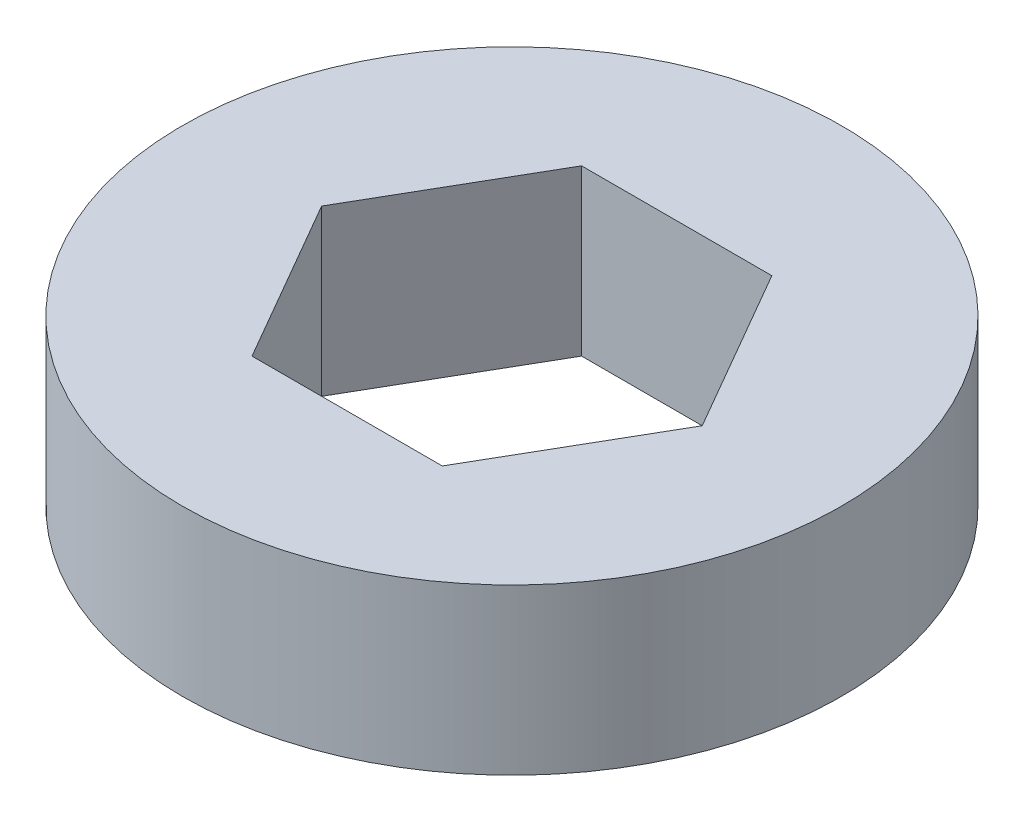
ISO-10303-21;
HEADER;
FILE_DESCRIPTION(('STEP AP214'),'2;1');
FILE_NAME('part.step','',(''),(''),'','','');
FILE_SCHEMA(('AUTOMOTIVE_DESIGN { 1 0 10303 214 1 1 1 1 }'));
ENDSEC;
DATA;
#1=APPLICATION_CONTEXT('core data for automotive mechanical design processes');
#2=APPLICATION_PROTOCOL_DEFINITION('international standard','automotive_design',2000,#1);
#3=PRODUCT_CONTEXT('',#1,'mechanical');
#4=PRODUCT('Part','Part','',(#3));
#5=PRODUCT_RELATED_PRODUCT_CATEGORY('part','',(#4));
#6=PRODUCT_DEFINITION_FORMATION('','',#4);
#7=PRODUCT_DEFINITION_CONTEXT('part definition',#1,'design');
#8=PRODUCT_DEFINITION('design','',#6,#7);
#9=PRODUCT_DEFINITION_SHAPE('','',#8);
#10=(LENGTH_UNIT() NAMED_UNIT(*) SI_UNIT(.MILLI.,.METRE.));
#11=(NAMED_UNIT(*) PLANE_ANGLE_UNIT() SI_UNIT($,.RADIAN.));
#12=(NAMED_UNIT(*) SI_UNIT($,.STERADIAN.) SOLID_ANGLE_UNIT());
#13=UNCERTAINTY_MEASURE_WITH_UNIT(LENGTH_MEASURE(1.E-05),#10,'distance_accuracy_value','');
#14=(GEOMETRIC_REPRESENTATION_CONTEXT(3) GLOBAL_UNCERTAINTY_ASSIGNED_CONTEXT((#13)) GLOBAL_UNIT_ASSIGNED_CONTEXT((#10,
#11,#12)) REPRESENTATION_CONTEXT('',''));
#15=CARTESIAN_POINT('',(0.,0.,0.));
#16=DIRECTION('',(0.,0.,1.));
#17=DIRECTION('',(1.,0.,0.));
#18=AXIS2_PLACEMENT_3D('',#15,#16,#17);
#19=CARTESIAN_POINT('',(0.,10.,0.));
#20=DIRECTION('',(0.,1.,0.));
#21=DIRECTION('',(0.,0.,1.));
#22=AXIS2_PLACEMENT_3D('',#19,#20,#21);
#23=PLANE('',#22);
#24=CARTESIAN_POINT('',(0.,10.,0.));
#25=DIRECTION('',(0.,1.,0.));
#26=DIRECTION('',(0.,0.,1.));
#27=AXIS2_PLACEMENT_3D('',#24,#25,#26);
#28=CIRCLE('',#27,20.);
#29=CARTESIAN_POINT('',(0.,10.,20.));
#30=VERTEX_POINT('',#29);
#31=EDGE_CURVE('E11',#30,#30,#28,.T.);
#32=ORIENTED_EDGE('',*,*,#31,.T.);
#33=EDGE_LOOP('',(#32));
#34=FACE_BOUND('',#33,.T.);
#35=DIRECTION('',(-0.5,0.,-0.866025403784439));
#36=VECTOR('',#35,1.);
#37=CARTESIAN_POINT('',(11.5470053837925,10.,0.));
#38=LINE('',#37,#36);
#39=CARTESIAN_POINT('',(11.5470053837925,10.,0.));
#40=VERTEX_POINT('',#39);
#41=CARTESIAN_POINT('',(5.77350269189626,10.,-10.));
#42=VERTEX_POINT('',#41);
#43=EDGE_CURVE('E94',#40,#42,#38,.T.);
#44=ORIENTED_EDGE('',*,*,#43,.F.);
#45=DIRECTION('',(0.5,0.,-0.866025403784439));
#46=VECTOR('',#45,1.);
#47=CARTESIAN_POINT('',(5.77350269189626,10.,10.));
#48=LINE('',#47,#46);
#49=CARTESIAN_POINT('',(5.77350269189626,10.,10.));
#50=VERTEX_POINT('',#49);
#51=EDGE_CURVE('E86',#50,#40,#48,.T.);
#52=ORIENTED_EDGE('',*,*,#51,.F.);
#53=DIRECTION('',(1.,0.,0.));
#54=VECTOR('',#53,1.);
#55=CARTESIAN_POINT('',(-5.77350269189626,10.,10.));
#56=LINE('',#55,#54);
#57=CARTESIAN_POINT('',(-5.77350269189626,10.,10.));
#58=VERTEX_POINT('',#57);
#59=EDGE_CURVE('E114',#58,#50,#56,.T.);
#60=ORIENTED_EDGE('',*,*,#59,.F.);
#61=DIRECTION('',(0.5,0.,0.866025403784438));
#62=VECTOR('',#61,1.);
#63=CARTESIAN_POINT('',(-11.5470053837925,10.,0.));
#64=LINE('',#63,#62);
#65=CARTESIAN_POINT('',(-11.5470053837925,10.,0.));
#66=VERTEX_POINT('',#65);
#67=EDGE_CURVE('E112',#66,#58,#64,.T.);
#68=ORIENTED_EDGE('',*,*,#67,.F.);
#69=DIRECTION('',(-0.5,0.,0.866025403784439));
#70=VECTOR('',#69,1.);
#71=CARTESIAN_POINT('',(-5.77350269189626,10.,-10.));
#72=LINE('',#71,#70);
#73=CARTESIAN_POINT('',(-5.77350269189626,10.,-10.));
#74=VERTEX_POINT('',#73);
#75=EDGE_CURVE('E108',#74,#66,#72,.T.);
#76=ORIENTED_EDGE('',*,*,#75,.F.);
#77=DIRECTION('',(-1.,0.,0.));
#78=VECTOR('',#77,1.);
#79=CARTESIAN_POINT('',(5.77350269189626,10.,-10.));
#80=LINE('',#79,#78);
#81=EDGE_CURVE('E106',#42,#74,#80,.T.);
#82=ORIENTED_EDGE('',*,*,#81,.F.);
#83=EDGE_LOOP('',(#44,#52,#60,#68,#76,#82));
#84=FACE_BOUND('',#83,.T.);
#85=ADVANCED_FACE('F33',(#34,#84),#23,.T.);
#86=CARTESIAN_POINT('',(0.,0.,0.));
#87=DIRECTION('',(0.,1.,0.));
#88=DIRECTION('',(0.,0.,1.));
#89=AXIS2_PLACEMENT_3D('',#86,#87,#88);
#90=PLANE('',#89);
#91=CARTESIAN_POINT('',(0.,0.,0.));
#92=DIRECTION('',(0.,1.,0.));
#93=DIRECTION('',(0.,0.,1.));
#94=AXIS2_PLACEMENT_3D('',#91,#92,#93);
#95=CIRCLE('',#94,20.);
#96=CARTESIAN_POINT('',(0.,0.,20.));
#97=VERTEX_POINT('',#96);
#98=EDGE_CURVE('E37',#97,#97,#95,.T.);
#99=ORIENTED_EDGE('',*,*,#98,.F.);
#100=EDGE_LOOP('',(#99));
#101=FACE_BOUND('',#100,.T.);
#102=DIRECTION('',(0.5,0.,-0.866025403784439));
#103=VECTOR('',#102,1.);
#104=CARTESIAN_POINT('',(5.77350269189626,0.,10.));
#105=LINE('',#104,#103);
#106=CARTESIAN_POINT('',(5.77350269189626,0.,10.));
#107=VERTEX_POINT('',#106);
#108=CARTESIAN_POINT('',(11.5470053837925,0.,0.));
#109=VERTEX_POINT('',#108);
#110=EDGE_CURVE('E56',#107,#109,#105,.T.);
#111=ORIENTED_EDGE('',*,*,#110,.T.);
#112=DIRECTION('',(-0.5,0.,-0.866025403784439));
#113=VECTOR('',#112,1.);
#114=CARTESIAN_POINT('',(11.5470053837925,0.,0.));
#115=LINE('',#114,#113);
#116=CARTESIAN_POINT('',(5.77350269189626,0.,-10.));
#117=VERTEX_POINT('',#116);
#118=EDGE_CURVE('E101',#109,#117,#115,.T.);
#119=ORIENTED_EDGE('',*,*,#118,.T.);
#120=DIRECTION('',(-1.,0.,0.));
#121=VECTOR('',#120,1.);
#122=CARTESIAN_POINT('',(5.77350269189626,0.,-10.));
#123=LINE('',#122,#121);
#124=CARTESIAN_POINT('',(-5.77350269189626,0.,-10.));
#125=VERTEX_POINT('',#124);
#126=EDGE_CURVE('E118',#117,#125,#123,.T.);
#127=ORIENTED_EDGE('',*,*,#126,.T.);
#128=DIRECTION('',(-0.5,0.,0.866025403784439));
#129=VECTOR('',#128,1.);
#130=CARTESIAN_POINT('',(-5.77350269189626,0.,-10.));
#131=LINE('',#130,#129);
#132=CARTESIAN_POINT('',(-11.5470053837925,0.,0.));
#133=VERTEX_POINT('',#132);
#134=EDGE_CURVE('E121',#125,#133,#131,.T.);
#135=ORIENTED_EDGE('',*,*,#134,.T.);
#136=DIRECTION('',(0.5,0.,0.866025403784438));
#137=VECTOR('',#136,1.);
#138=CARTESIAN_POINT('',(-11.5470053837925,0.,0.));
#139=LINE('',#138,#137);
#140=CARTESIAN_POINT('',(-5.77350269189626,0.,10.));
#141=VERTEX_POINT('',#140);
#142=EDGE_CURVE('E124',#133,#141,#139,.T.);
#143=ORIENTED_EDGE('',*,*,#142,.T.);
#144=DIRECTION('',(1.,0.,0.));
#145=VECTOR('',#144,1.);
#146=CARTESIAN_POINT('',(-5.77350269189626,0.,10.));
#147=LINE('',#146,#145);
#148=EDGE_CURVE('E95',#141,#107,#147,.T.);
#149=ORIENTED_EDGE('',*,*,#148,.T.);
#150=EDGE_LOOP('',(#111,#119,#127,#135,#143,#149));
#151=FACE_BOUND('',#150,.T.);
#152=ADVANCED_FACE('F141',(#101,#151),#90,.F.);
#153=CARTESIAN_POINT('',(0.,10.,0.));
#154=DIRECTION('',(0.,-1.,0.));
#155=DIRECTION('',(0.,0.,-1.));
#156=AXIS2_PLACEMENT_3D('',#153,#154,#155);
#157=CYLINDRICAL_SURFACE('',#156,20.);
#158=ORIENTED_EDGE('',*,*,#31,.F.);
#159=EDGE_LOOP('',(#158));
#160=FACE_BOUND('',#159,.T.);
#161=ORIENTED_EDGE('',*,*,#98,.T.);
#162=EDGE_LOOP('',(#161));
#163=FACE_BOUND('',#162,.T.);
#164=ADVANCED_FACE('F35',(#160,#163),#157,.T.);
#165=CARTESIAN_POINT('',(5.77350269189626,10.,10.));
#166=DIRECTION('',(-0.866025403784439,0.,-0.5));
#167=DIRECTION('',(-0.5,0.,0.866025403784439));
#168=AXIS2_PLACEMENT_3D('',#165,#166,#167);
#169=PLANE('',#168);
#170=ORIENTED_EDGE('',*,*,#110,.F.);
#171=DIRECTION('',(0.,-1.,0.));
#172=VECTOR('',#171,1.);
#173=CARTESIAN_POINT('',(5.77350269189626,10.,10.));
#174=LINE('',#173,#172);
#175=EDGE_CURVE('E90',#50,#107,#174,.T.);
#176=ORIENTED_EDGE('',*,*,#175,.F.);
#177=ORIENTED_EDGE('',*,*,#51,.T.);
#178=DIRECTION('',(0.,-1.,0.));
#179=VECTOR('',#178,1.);
#180=CARTESIAN_POINT('',(11.5470053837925,10.,0.));
#181=LINE('',#180,#179);
#182=EDGE_CURVE('E89',#40,#109,#181,.T.);
#183=ORIENTED_EDGE('',*,*,#182,.T.);
#184=EDGE_LOOP('',(#170,#176,#177,#183));
#185=FACE_BOUND('',#184,.T.);
#186=ADVANCED_FACE('F88',(#185),#169,.T.);
#187=CARTESIAN_POINT('',(11.5470053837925,10.,0.));
#188=DIRECTION('',(-0.866025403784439,0.,0.5));
#189=DIRECTION('',(0.5,0.,0.866025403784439));
#190=AXIS2_PLACEMENT_3D('',#187,#188,#189);
#191=PLANE('',#190);
#192=ORIENTED_EDGE('',*,*,#118,.F.);
#193=ORIENTED_EDGE('',*,*,#182,.F.);
#194=ORIENTED_EDGE('',*,*,#43,.T.);
#195=DIRECTION('',(0.,-1.,0.));
#196=VECTOR('',#195,1.);
#197=CARTESIAN_POINT('',(5.77350269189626,10.,-10.));
#198=LINE('',#197,#196);
#199=EDGE_CURVE('E102',#42,#117,#198,.T.);
#200=ORIENTED_EDGE('',*,*,#199,.T.);
#201=EDGE_LOOP('',(#192,#193,#194,#200));
#202=FACE_BOUND('',#201,.T.);
#203=ADVANCED_FACE('F98',(#202),#191,.T.);
#204=CARTESIAN_POINT('',(5.77350269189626,10.,-10.));
#205=DIRECTION('',(0.,0.,1.));
#206=DIRECTION('',(1.,0.,0.));
#207=AXIS2_PLACEMENT_3D('',#204,#205,#206);
#208=PLANE('',#207);
#209=ORIENTED_EDGE('',*,*,#126,.F.);
#210=ORIENTED_EDGE('',*,*,#199,.F.);
#211=ORIENTED_EDGE('',*,*,#81,.T.);
#212=DIRECTION('',(0.,-1.,0.));
#213=VECTOR('',#212,1.);
#214=CARTESIAN_POINT('',(-5.77350269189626,10.,-10.));
#215=LINE('',#214,#213);
#216=EDGE_CURVE('E133',#74,#125,#215,.T.);
#217=ORIENTED_EDGE('',*,*,#216,.T.);
#218=EDGE_LOOP('',(#209,#210,#211,#217));
#219=FACE_BOUND('',#218,.T.);
#220=ADVANCED_FACE('F137',(#219),#208,.T.);
#221=CARTESIAN_POINT('',(-5.77350269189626,10.,-10.));
#222=DIRECTION('',(0.866025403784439,0.,0.5));
#223=DIRECTION('',(0.5,0.,-0.866025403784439));
#224=AXIS2_PLACEMENT_3D('',#221,#222,#223);
#225=PLANE('',#224);
#226=ORIENTED_EDGE('',*,*,#134,.F.);
#227=ORIENTED_EDGE('',*,*,#216,.F.);
#228=ORIENTED_EDGE('',*,*,#75,.T.);
#229=DIRECTION('',(0.,-1.,0.));
#230=VECTOR('',#229,1.);
#231=CARTESIAN_POINT('',(-11.5470053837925,10.,0.));
#232=LINE('',#231,#230);
#233=EDGE_CURVE('E131',#66,#133,#232,.T.);
#234=ORIENTED_EDGE('',*,*,#233,.T.);
#235=EDGE_LOOP('',(#226,#227,#228,#234));
#236=FACE_BOUND('',#235,.T.);
#237=ADVANCED_FACE('F149',(#236),#225,.T.);
#238=CARTESIAN_POINT('',(-11.5470053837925,10.,0.));
#239=DIRECTION('',(0.866025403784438,0.,-0.5));
#240=DIRECTION('',(-0.5,0.,-0.866025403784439));
#241=AXIS2_PLACEMENT_3D('',#238,#239,#240);
#242=PLANE('',#241);
#243=ORIENTED_EDGE('',*,*,#142,.F.);
#244=ORIENTED_EDGE('',*,*,#233,.F.);
#245=ORIENTED_EDGE('',*,*,#67,.T.);
#246=DIRECTION('',(0.,-1.,0.));
#247=VECTOR('',#246,1.);
#248=CARTESIAN_POINT('',(-5.77350269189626,10.,10.));
#249=LINE('',#248,#247);
#250=EDGE_CURVE('E48',#58,#141,#249,.T.);
#251=ORIENTED_EDGE('',*,*,#250,.T.);
#252=EDGE_LOOP('',(#243,#244,#245,#251));
#253=FACE_BOUND('',#252,.T.);
#254=ADVANCED_FACE('F147',(#253),#242,.T.);
#255=CARTESIAN_POINT('',(-5.77350269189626,10.,10.));
#256=DIRECTION('',(0.,0.,-1.));
#257=DIRECTION('',(-1.,0.,0.));
#258=AXIS2_PLACEMENT_3D('',#255,#256,#257);
#259=PLANE('',#258);
#260=ORIENTED_EDGE('',*,*,#148,.F.);
#261=ORIENTED_EDGE('',*,*,#250,.F.);
#262=ORIENTED_EDGE('',*,*,#59,.T.);
#263=ORIENTED_EDGE('',*,*,#175,.T.);
#264=EDGE_LOOP('',(#260,#261,#262,#263));
#265=FACE_BOUND('',#264,.T.);
#266=ADVANCED_FACE('F143',(#265),#259,.T.);
#267=CLOSED_SHELL('',(#85,#152,#164,#186,#203,#220,#237,#254,#266));
#268=MANIFOLD_SOLID_BREP('B2',#267);
#269=ADVANCED_BREP_SHAPE_REPRESENTATION('',(#18,#268),#14);
#270=SHAPE_DEFINITION_REPRESENTATION(#9,#269);
ENDSEC;
END-ISO-10303-21;
